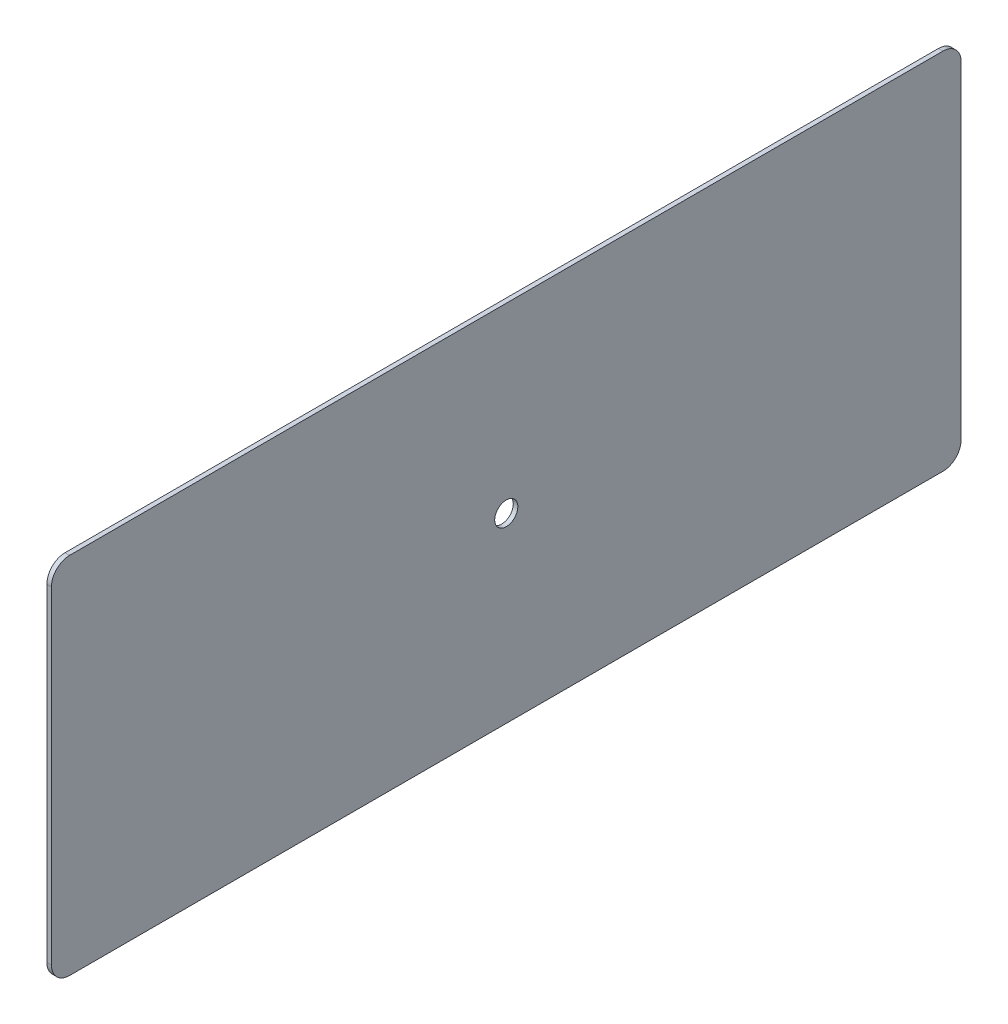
ISO-10303-21;
HEADER;
FILE_DESCRIPTION(('STEP AP214'),'2;1');
FILE_NAME('part.step','',(''),(''),'','','');
FILE_SCHEMA(('AUTOMOTIVE_DESIGN { 1 0 10303 214 1 1 1 1 }'));
ENDSEC;
DATA;
#1=APPLICATION_CONTEXT('core data for automotive mechanical design processes');
#2=APPLICATION_PROTOCOL_DEFINITION('international standard','automotive_design',2000,#1);
#3=PRODUCT_CONTEXT('',#1,'mechanical');
#4=PRODUCT('Part','Part','',(#3));
#5=PRODUCT_RELATED_PRODUCT_CATEGORY('part','',(#4));
#6=PRODUCT_DEFINITION_FORMATION('','',#4);
#7=PRODUCT_DEFINITION_CONTEXT('part definition',#1,'design');
#8=PRODUCT_DEFINITION('design','',#6,#7);
#9=PRODUCT_DEFINITION_SHAPE('','',#8);
#10=(LENGTH_UNIT() NAMED_UNIT(*) SI_UNIT(.MILLI.,.METRE.));
#11=(NAMED_UNIT(*) PLANE_ANGLE_UNIT() SI_UNIT($,.RADIAN.));
#12=(NAMED_UNIT(*) SI_UNIT($,.STERADIAN.) SOLID_ANGLE_UNIT());
#13=UNCERTAINTY_MEASURE_WITH_UNIT(LENGTH_MEASURE(1.E-05),#10,'distance_accuracy_value','');
#14=(GEOMETRIC_REPRESENTATION_CONTEXT(3) GLOBAL_UNCERTAINTY_ASSIGNED_CONTEXT((#13)) GLOBAL_UNIT_ASSIGNED_CONTEXT((#10,
#11,#12)) REPRESENTATION_CONTEXT('',''));
#15=CARTESIAN_POINT('',(0.,0.,0.));
#16=DIRECTION('',(0.,0.,1.));
#17=DIRECTION('',(1.,0.,0.));
#18=AXIS2_PLACEMENT_3D('',#15,#16,#17);
#19=CARTESIAN_POINT('',(2.5,0.,0.));
#20=DIRECTION('',(1.,0.,0.));
#21=DIRECTION('',(0.,0.,-1.));
#22=AXIS2_PLACEMENT_3D('',#19,#20,#21);
#23=PLANE('',#22);
#24=DIRECTION('',(0.,-1.,0.));
#25=VECTOR('',#24,1.);
#26=CARTESIAN_POINT('',(2.5,-100.,250.));
#27=LINE('',#26,#25);
#28=CARTESIAN_POINT('',(2.5,89.9999999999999,250.));
#29=VERTEX_POINT('',#28);
#30=CARTESIAN_POINT('',(2.5,-90.0000000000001,250.));
#31=VERTEX_POINT('',#30);
#32=EDGE_CURVE('E137',#29,#31,#27,.T.);
#33=ORIENTED_EDGE('',*,*,#32,.T.);
#34=CARTESIAN_POINT('',(2.5,-90.0000000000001,240.));
#35=DIRECTION('',(1.,0.,0.));
#36=DIRECTION('',(0.,0.,-1.));
#37=AXIS2_PLACEMENT_3D('',#34,#35,#36);
#38=CIRCLE('',#37,10.);
#39=CARTESIAN_POINT('',(2.5,-100.,240.));
#40=VERTEX_POINT('',#39);
#41=EDGE_CURVE('E152',#31,#40,#38,.T.);
#42=ORIENTED_EDGE('',*,*,#41,.T.);
#43=DIRECTION('',(0.,0.,-1.));
#44=VECTOR('',#43,1.);
#45=CARTESIAN_POINT('',(2.5,-100.,-250.));
#46=LINE('',#45,#44);
#47=CARTESIAN_POINT('',(2.5,-100.,-240.));
#48=VERTEX_POINT('',#47);
#49=EDGE_CURVE('E119',#40,#48,#46,.T.);
#50=ORIENTED_EDGE('',*,*,#49,.T.);
#51=CARTESIAN_POINT('',(2.5,-90.,-240.));
#52=DIRECTION('',(1.,0.,0.));
#53=DIRECTION('',(0.,0.,-1.));
#54=AXIS2_PLACEMENT_3D('',#51,#52,#53);
#55=CIRCLE('',#54,10.);
#56=CARTESIAN_POINT('',(2.5,-90.,-250.));
#57=VERTEX_POINT('',#56);
#58=EDGE_CURVE('E150',#48,#57,#55,.T.);
#59=ORIENTED_EDGE('',*,*,#58,.T.);
#60=DIRECTION('',(0.,1.,0.));
#61=VECTOR('',#60,1.);
#62=CARTESIAN_POINT('',(2.5,-100.,-250.));
#63=LINE('',#62,#61);
#64=CARTESIAN_POINT('',(2.5,90.,-250.));
#65=VERTEX_POINT('',#64);
#66=EDGE_CURVE('E163',#57,#65,#63,.T.);
#67=ORIENTED_EDGE('',*,*,#66,.T.);
#68=CARTESIAN_POINT('',(2.5,90.,-240.));
#69=DIRECTION('',(1.,0.,0.));
#70=DIRECTION('',(0.,0.,-1.));
#71=AXIS2_PLACEMENT_3D('',#68,#69,#70);
#72=CIRCLE('',#71,10.);
#73=CARTESIAN_POINT('',(2.5,100.,-240.));
#74=VERTEX_POINT('',#73);
#75=EDGE_CURVE('E54',#65,#74,#72,.T.);
#76=ORIENTED_EDGE('',*,*,#75,.T.);
#77=DIRECTION('',(0.,0.,1.));
#78=VECTOR('',#77,1.);
#79=CARTESIAN_POINT('',(2.5,100.,-250.));
#80=LINE('',#79,#78);
#81=CARTESIAN_POINT('',(2.5,99.9999999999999,240.));
#82=VERTEX_POINT('',#81);
#83=EDGE_CURVE('E138',#74,#82,#80,.T.);
#84=ORIENTED_EDGE('',*,*,#83,.T.);
#85=CARTESIAN_POINT('',(2.5,89.9999999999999,240.));
#86=DIRECTION('',(1.,0.,0.));
#87=DIRECTION('',(0.,0.,-1.));
#88=AXIS2_PLACEMENT_3D('',#85,#86,#87);
#89=CIRCLE('',#88,10.);
#90=EDGE_CURVE('E147',#82,#29,#89,.T.);
#91=ORIENTED_EDGE('',*,*,#90,.T.);
#92=EDGE_LOOP('',(#33,#42,#50,#59,#67,#76,#84,#91));
#93=FACE_BOUND('',#92,.T.);
#94=CARTESIAN_POINT('',(2.5,0.,0.));
#95=DIRECTION('',(1.,0.,0.));
#96=DIRECTION('',(0.,0.,-1.));
#97=AXIS2_PLACEMENT_3D('',#94,#95,#96);
#98=CIRCLE('',#97,6.35);
#99=CARTESIAN_POINT('',(2.5,0.,-6.35));
#100=VERTEX_POINT('',#99);
#101=EDGE_CURVE('E132',#100,#100,#98,.T.);
#102=ORIENTED_EDGE('',*,*,#101,.F.);
#103=EDGE_LOOP('',(#102));
#104=FACE_BOUND('',#103,.T.);
#105=ADVANCED_FACE('F33',(#93,#104),#23,.T.);
#106=CARTESIAN_POINT('',(0.,0.,0.));
#107=DIRECTION('',(1.,0.,0.));
#108=DIRECTION('',(0.,0.,-1.));
#109=AXIS2_PLACEMENT_3D('',#106,#107,#108);
#110=PLANE('',#109);
#111=DIRECTION('',(0.,0.,-1.));
#112=VECTOR('',#111,1.);
#113=CARTESIAN_POINT('',(0.,-100.,-250.));
#114=LINE('',#113,#112);
#115=CARTESIAN_POINT('',(0.,-100.,240.));
#116=VERTEX_POINT('',#115);
#117=CARTESIAN_POINT('',(0.,-100.,-240.));
#118=VERTEX_POINT('',#117);
#119=EDGE_CURVE('E116',#116,#118,#114,.T.);
#120=ORIENTED_EDGE('',*,*,#119,.F.);
#121=CARTESIAN_POINT('',(0.,-90.0000000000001,240.));
#122=DIRECTION('',(1.,0.,0.));
#123=DIRECTION('',(0.,0.,-1.));
#124=AXIS2_PLACEMENT_3D('',#121,#122,#123);
#125=CIRCLE('',#124,10.);
#126=CARTESIAN_POINT('',(0.,-90.0000000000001,250.));
#127=VERTEX_POINT('',#126);
#128=EDGE_CURVE('E99',#116,#127,#125,.F.);
#129=ORIENTED_EDGE('',*,*,#128,.T.);
#130=DIRECTION('',(0.,-1.,0.));
#131=VECTOR('',#130,1.);
#132=CARTESIAN_POINT('',(0.,-100.,250.));
#133=LINE('',#132,#131);
#134=CARTESIAN_POINT('',(0.,89.9999999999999,250.));
#135=VERTEX_POINT('',#134);
#136=EDGE_CURVE('E127',#135,#127,#133,.T.);
#137=ORIENTED_EDGE('',*,*,#136,.F.);
#138=CARTESIAN_POINT('',(0.,89.9999999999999,240.));
#139=DIRECTION('',(1.,0.,0.));
#140=DIRECTION('',(0.,0.,-1.));
#141=AXIS2_PLACEMENT_3D('',#138,#139,#140);
#142=CIRCLE('',#141,10.);
#143=CARTESIAN_POINT('',(0.,99.9999999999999,240.));
#144=VERTEX_POINT('',#143);
#145=EDGE_CURVE('E120',#135,#144,#142,.F.);
#146=ORIENTED_EDGE('',*,*,#145,.T.);
#147=DIRECTION('',(0.,0.,1.));
#148=VECTOR('',#147,1.);
#149=CARTESIAN_POINT('',(0.,100.,-250.));
#150=LINE('',#149,#148);
#151=CARTESIAN_POINT('',(0.,100.,-240.));
#152=VERTEX_POINT('',#151);
#153=EDGE_CURVE('E130',#152,#144,#150,.T.);
#154=ORIENTED_EDGE('',*,*,#153,.F.);
#155=CARTESIAN_POINT('',(0.,90.,-240.));
#156=DIRECTION('',(1.,0.,0.));
#157=DIRECTION('',(0.,0.,-1.));
#158=AXIS2_PLACEMENT_3D('',#155,#156,#157);
#159=CIRCLE('',#158,10.);
#160=CARTESIAN_POINT('',(0.,90.,-250.));
#161=VERTEX_POINT('',#160);
#162=EDGE_CURVE('E141',#152,#161,#159,.F.);
#163=ORIENTED_EDGE('',*,*,#162,.T.);
#164=DIRECTION('',(0.,1.,0.));
#165=VECTOR('',#164,1.);
#166=CARTESIAN_POINT('',(0.,-100.,-250.));
#167=LINE('',#166,#165);
#168=CARTESIAN_POINT('',(0.,-90.,-250.));
#169=VERTEX_POINT('',#168);
#170=EDGE_CURVE('E126',#169,#161,#167,.T.);
#171=ORIENTED_EDGE('',*,*,#170,.F.);
#172=CARTESIAN_POINT('',(0.,-90.,-240.));
#173=DIRECTION('',(1.,0.,0.));
#174=DIRECTION('',(0.,0.,-1.));
#175=AXIS2_PLACEMENT_3D('',#172,#173,#174);
#176=CIRCLE('',#175,10.);
#177=EDGE_CURVE('E110',#169,#118,#176,.F.);
#178=ORIENTED_EDGE('',*,*,#177,.T.);
#179=EDGE_LOOP('',(#120,#129,#137,#146,#154,#163,#171,#178));
#180=FACE_BOUND('',#179,.T.);
#181=CARTESIAN_POINT('',(0.,0.,0.));
#182=DIRECTION('',(1.,0.,0.));
#183=DIRECTION('',(0.,0.,-1.));
#184=AXIS2_PLACEMENT_3D('',#181,#182,#183);
#185=CIRCLE('',#184,6.35);
#186=CARTESIAN_POINT('',(0.,0.,-6.35));
#187=VERTEX_POINT('',#186);
#188=EDGE_CURVE('E177',#187,#187,#185,.T.);
#189=ORIENTED_EDGE('',*,*,#188,.T.);
#190=EDGE_LOOP('',(#189));
#191=FACE_BOUND('',#190,.T.);
#192=ADVANCED_FACE('F123',(#180,#191),#110,.F.);
#193=CARTESIAN_POINT('',(2.5,-100.,250.));
#194=DIRECTION('',(0.,0.,-1.));
#195=DIRECTION('',(-1.,0.,0.));
#196=AXIS2_PLACEMENT_3D('',#193,#194,#195);
#197=PLANE('',#196);
#198=ORIENTED_EDGE('',*,*,#136,.T.);
#199=DIRECTION('',(-1.,0.,0.));
#200=VECTOR('',#199,1.);
#201=CARTESIAN_POINT('',(2.5,-90.0000000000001,250.));
#202=LINE('',#201,#200);
#203=EDGE_CURVE('E104',#127,#31,#202,.F.);
#204=ORIENTED_EDGE('',*,*,#203,.T.);
#205=ORIENTED_EDGE('',*,*,#32,.F.);
#206=DIRECTION('',(-1.,0.,0.));
#207=VECTOR('',#206,1.);
#208=CARTESIAN_POINT('',(2.5,89.9999999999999,250.));
#209=LINE('',#208,#207);
#210=EDGE_CURVE('E109',#29,#135,#209,.T.);
#211=ORIENTED_EDGE('',*,*,#210,.T.);
#212=EDGE_LOOP('',(#198,#204,#205,#211));
#213=FACE_BOUND('',#212,.T.);
#214=ADVANCED_FACE('F191',(#213),#197,.F.);
#215=CARTESIAN_POINT('',(2.5,-100.,-250.));
#216=DIRECTION('',(0.,1.,0.));
#217=DIRECTION('',(0.,0.,1.));
#218=AXIS2_PLACEMENT_3D('',#215,#216,#217);
#219=PLANE('',#218);
#220=ORIENTED_EDGE('',*,*,#49,.F.);
#221=DIRECTION('',(-1.,0.,0.));
#222=VECTOR('',#221,1.);
#223=CARTESIAN_POINT('',(2.5,-100.,240.));
#224=LINE('',#223,#222);
#225=EDGE_CURVE('E103',#40,#116,#224,.T.);
#226=ORIENTED_EDGE('',*,*,#225,.T.);
#227=ORIENTED_EDGE('',*,*,#119,.T.);
#228=DIRECTION('',(-1.,0.,0.));
#229=VECTOR('',#228,1.);
#230=CARTESIAN_POINT('',(2.5,-100.,-240.));
#231=LINE('',#230,#229);
#232=EDGE_CURVE('E121',#118,#48,#231,.F.);
#233=ORIENTED_EDGE('',*,*,#232,.T.);
#234=EDGE_LOOP('',(#220,#226,#227,#233));
#235=FACE_BOUND('',#234,.T.);
#236=ADVANCED_FACE('F115',(#235),#219,.F.);
#237=CARTESIAN_POINT('',(2.5,-100.,-250.));
#238=DIRECTION('',(0.,0.,1.));
#239=DIRECTION('',(1.,0.,0.));
#240=AXIS2_PLACEMENT_3D('',#237,#238,#239);
#241=PLANE('',#240);
#242=ORIENTED_EDGE('',*,*,#66,.F.);
#243=DIRECTION('',(-1.,0.,0.));
#244=VECTOR('',#243,1.);
#245=CARTESIAN_POINT('',(2.5,-90.,-250.));
#246=LINE('',#245,#244);
#247=EDGE_CURVE('E156',#57,#169,#246,.T.);
#248=ORIENTED_EDGE('',*,*,#247,.T.);
#249=ORIENTED_EDGE('',*,*,#170,.T.);
#250=DIRECTION('',(-1.,0.,0.));
#251=VECTOR('',#250,1.);
#252=CARTESIAN_POINT('',(2.5,90.,-250.));
#253=LINE('',#252,#251);
#254=EDGE_CURVE('E154',#161,#65,#253,.F.);
#255=ORIENTED_EDGE('',*,*,#254,.T.);
#256=EDGE_LOOP('',(#242,#248,#249,#255));
#257=FACE_BOUND('',#256,.T.);
#258=ADVANCED_FACE('F161',(#257),#241,.F.);
#259=CARTESIAN_POINT('',(2.5,100.,-250.));
#260=DIRECTION('',(0.,-1.,0.));
#261=DIRECTION('',(0.,0.,-1.));
#262=AXIS2_PLACEMENT_3D('',#259,#260,#261);
#263=PLANE('',#262);
#264=ORIENTED_EDGE('',*,*,#83,.F.);
#265=DIRECTION('',(-1.,0.,0.));
#266=VECTOR('',#265,1.);
#267=CARTESIAN_POINT('',(2.5,100.,-240.));
#268=LINE('',#267,#266);
#269=EDGE_CURVE('E11',#74,#152,#268,.T.);
#270=ORIENTED_EDGE('',*,*,#269,.T.);
#271=ORIENTED_EDGE('',*,*,#153,.T.);
#272=DIRECTION('',(-1.,0.,0.));
#273=VECTOR('',#272,1.);
#274=CARTESIAN_POINT('',(2.5,99.9999999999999,240.));
#275=LINE('',#274,#273);
#276=EDGE_CURVE('E41',#144,#82,#275,.F.);
#277=ORIENTED_EDGE('',*,*,#276,.T.);
#278=EDGE_LOOP('',(#264,#270,#271,#277));
#279=FACE_BOUND('',#278,.T.);
#280=ADVANCED_FACE('F170',(#279),#263,.F.);
#281=CARTESIAN_POINT('',(2.5,0.,0.));
#282=DIRECTION('',(-1.,0.,0.));
#283=DIRECTION('',(0.,0.,1.));
#284=AXIS2_PLACEMENT_3D('',#281,#282,#283);
#285=CYLINDRICAL_SURFACE('',#284,6.35);
#286=ORIENTED_EDGE('',*,*,#101,.T.);
#287=EDGE_LOOP('',(#286));
#288=FACE_BOUND('',#287,.T.);
#289=ORIENTED_EDGE('',*,*,#188,.F.);
#290=EDGE_LOOP('',(#289));
#291=FACE_BOUND('',#290,.T.);
#292=ADVANCED_FACE('F183',(#288,#291),#285,.F.);
#293=CARTESIAN_POINT('',(2.5,-90.0000000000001,240.));
#294=DIRECTION('',(-1.,0.,0.));
#295=DIRECTION('',(0.,0.,1.));
#296=AXIS2_PLACEMENT_3D('',#293,#294,#295);
#297=CYLINDRICAL_SURFACE('',#296,10.);
#298=ORIENTED_EDGE('',*,*,#41,.F.);
#299=ORIENTED_EDGE('',*,*,#203,.F.);
#300=ORIENTED_EDGE('',*,*,#128,.F.);
#301=ORIENTED_EDGE('',*,*,#225,.F.);
#302=EDGE_LOOP('',(#298,#299,#300,#301));
#303=FACE_BOUND('',#302,.T.);
#304=ADVANCED_FACE('F102',(#303),#297,.T.);
#305=CARTESIAN_POINT('',(2.5,-90.,-240.));
#306=DIRECTION('',(-1.,0.,0.));
#307=DIRECTION('',(0.,0.,1.));
#308=AXIS2_PLACEMENT_3D('',#305,#306,#307);
#309=CYLINDRICAL_SURFACE('',#308,10.);
#310=ORIENTED_EDGE('',*,*,#58,.F.);
#311=ORIENTED_EDGE('',*,*,#232,.F.);
#312=ORIENTED_EDGE('',*,*,#177,.F.);
#313=ORIENTED_EDGE('',*,*,#247,.F.);
#314=EDGE_LOOP('',(#310,#311,#312,#313));
#315=FACE_BOUND('',#314,.T.);
#316=ADVANCED_FACE('F206',(#315),#309,.T.);
#317=CARTESIAN_POINT('',(2.5,90.,-240.));
#318=DIRECTION('',(-1.,0.,0.));
#319=DIRECTION('',(0.,0.,1.));
#320=AXIS2_PLACEMENT_3D('',#317,#318,#319);
#321=CYLINDRICAL_SURFACE('',#320,10.);
#322=ORIENTED_EDGE('',*,*,#75,.F.);
#323=ORIENTED_EDGE('',*,*,#254,.F.);
#324=ORIENTED_EDGE('',*,*,#162,.F.);
#325=ORIENTED_EDGE('',*,*,#269,.F.);
#326=EDGE_LOOP('',(#322,#323,#324,#325));
#327=FACE_BOUND('',#326,.T.);
#328=ADVANCED_FACE('F169',(#327),#321,.T.);
#329=CARTESIAN_POINT('',(2.5,89.9999999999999,240.));
#330=DIRECTION('',(-1.,0.,0.));
#331=DIRECTION('',(0.,0.,1.));
#332=AXIS2_PLACEMENT_3D('',#329,#330,#331);
#333=CYLINDRICAL_SURFACE('',#332,10.);
#334=ORIENTED_EDGE('',*,*,#90,.F.);
#335=ORIENTED_EDGE('',*,*,#276,.F.);
#336=ORIENTED_EDGE('',*,*,#145,.F.);
#337=ORIENTED_EDGE('',*,*,#210,.F.);
#338=EDGE_LOOP('',(#334,#335,#336,#337));
#339=FACE_BOUND('',#338,.T.);
#340=ADVANCED_FACE('F35',(#339),#333,.T.);
#341=CLOSED_SHELL('',(#105,#192,#214,#236,#258,#280,#292,#304,#316,#328,#340));
#342=MANIFOLD_SOLID_BREP('B2',#341);
#343=ADVANCED_BREP_SHAPE_REPRESENTATION('',(#18,#342),#14);
#344=SHAPE_DEFINITION_REPRESENTATION(#9,#343);
ENDSEC;
END-ISO-10303-21;
